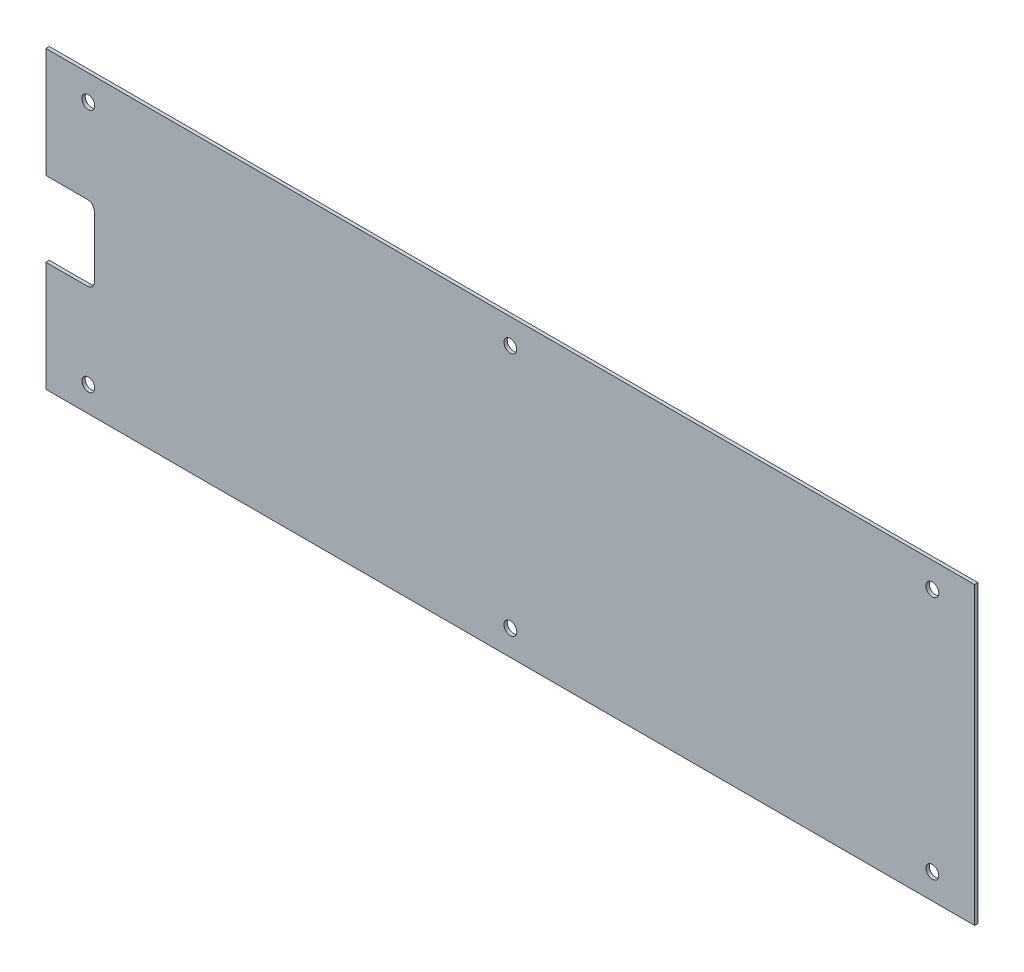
ISO-10303-21;
HEADER;
FILE_DESCRIPTION(('STEP AP214'),'2;1');
FILE_NAME('part.step','',(''),(''),'','','');
FILE_SCHEMA(('AUTOMOTIVE_DESIGN { 1 0 10303 214 1 1 1 1 }'));
ENDSEC;
DATA;
#1=APPLICATION_CONTEXT('core data for automotive mechanical design processes');
#2=APPLICATION_PROTOCOL_DEFINITION('international standard','automotive_design',2000,#1);
#3=PRODUCT_CONTEXT('',#1,'mechanical');
#4=PRODUCT('Part','Part','',(#3));
#5=PRODUCT_RELATED_PRODUCT_CATEGORY('part','',(#4));
#6=PRODUCT_DEFINITION_FORMATION('','',#4);
#7=PRODUCT_DEFINITION_CONTEXT('part definition',#1,'design');
#8=PRODUCT_DEFINITION('design','',#6,#7);
#9=PRODUCT_DEFINITION_SHAPE('','',#8);
#10=(LENGTH_UNIT() NAMED_UNIT(*) SI_UNIT(.MILLI.,.METRE.));
#11=(NAMED_UNIT(*) PLANE_ANGLE_UNIT() SI_UNIT($,.RADIAN.));
#12=(NAMED_UNIT(*) SI_UNIT($,.STERADIAN.) SOLID_ANGLE_UNIT());
#13=UNCERTAINTY_MEASURE_WITH_UNIT(LENGTH_MEASURE(1.E-05),#10,'distance_accuracy_value','');
#14=(GEOMETRIC_REPRESENTATION_CONTEXT(3) GLOBAL_UNCERTAINTY_ASSIGNED_CONTEXT((#13)) GLOBAL_UNIT_ASSIGNED_CONTEXT((#10,
#11,#12)) REPRESENTATION_CONTEXT('',''));
#15=CARTESIAN_POINT('',(0.,0.,0.));
#16=DIRECTION('',(0.,0.,1.));
#17=DIRECTION('',(1.,0.,0.));
#18=AXIS2_PLACEMENT_3D('',#15,#16,#17);
#19=CARTESIAN_POINT('',(0.,0.,0.79375));
#20=DIRECTION('',(1.,0.,0.));
#21=DIRECTION('',(0.,0.,-1.));
#22=AXIS2_PLACEMENT_3D('',#19,#20,#21);
#23=PLANE('',#22);
#24=DIRECTION('',(0.,-1.,0.));
#25=VECTOR('',#24,1.);
#26=CARTESIAN_POINT('',(0.,0.,0.));
#27=LINE('',#26,#25);
#28=CARTESIAN_POINT('',(0.,69.85,0.));
#29=VERTEX_POINT('',#28);
#30=CARTESIAN_POINT('',(0.,43.815,0.));
#31=VERTEX_POINT('',#30);
#32=EDGE_CURVE('E124',#29,#31,#27,.T.);
#33=ORIENTED_EDGE('',*,*,#32,.T.);
#34=DIRECTION('',(0.,0.,1.));
#35=VECTOR('',#34,1.);
#36=CARTESIAN_POINT('',(0.,43.815,-1.74625));
#37=LINE('',#36,#35);
#38=CARTESIAN_POINT('',(0.,43.815,0.79375));
#39=VERTEX_POINT('',#38);
#40=EDGE_CURVE('E110',#31,#39,#37,.T.);
#41=ORIENTED_EDGE('',*,*,#40,.T.);
#42=DIRECTION('',(0.,-1.,0.));
#43=VECTOR('',#42,1.);
#44=CARTESIAN_POINT('',(0.,0.,0.79375));
#45=LINE('',#44,#43);
#46=CARTESIAN_POINT('',(0.,69.85,0.79375));
#47=VERTEX_POINT('',#46);
#48=EDGE_CURVE('E122',#47,#39,#45,.T.);
#49=ORIENTED_EDGE('',*,*,#48,.F.);
#50=DIRECTION('',(0.,0.,-1.));
#51=VECTOR('',#50,1.);
#52=CARTESIAN_POINT('',(0.,69.85,0.79375));
#53=LINE('',#52,#51);
#54=EDGE_CURVE('E140',#47,#29,#53,.T.);
#55=ORIENTED_EDGE('',*,*,#54,.T.);
#56=EDGE_LOOP('',(#33,#41,#49,#55));
#57=FACE_BOUND('',#56,.T.);
#58=ADVANCED_FACE('F31',(#57),#23,.F.);
#59=CARTESIAN_POINT('',(0.,26.035,0.79375));
#60=VERTEX_POINT('',#59);
#61=CARTESIAN_POINT('',(0.,0.,0.79375));
#62=VERTEX_POINT('',#61);
#63=EDGE_CURVE('E130',#60,#62,#45,.T.);
#64=ORIENTED_EDGE('',*,*,#63,.F.);
#65=DIRECTION('',(0.,0.,1.));
#66=VECTOR('',#65,1.);
#67=CARTESIAN_POINT('',(0.,26.035,-1.74625));
#68=LINE('',#67,#66);
#69=CARTESIAN_POINT('',(0.,26.035,0.));
#70=VERTEX_POINT('',#69);
#71=EDGE_CURVE('E125',#70,#60,#68,.T.);
#72=ORIENTED_EDGE('',*,*,#71,.F.);
#73=CARTESIAN_POINT('',(0.,0.,0.));
#74=VERTEX_POINT('',#73);
#75=EDGE_CURVE('E222',#70,#74,#27,.T.);
#76=ORIENTED_EDGE('',*,*,#75,.T.);
#77=DIRECTION('',(0.,0.,-1.));
#78=VECTOR('',#77,1.);
#79=CARTESIAN_POINT('',(0.,0.,0.79375));
#80=LINE('',#79,#78);
#81=EDGE_CURVE('E148',#62,#74,#80,.T.);
#82=ORIENTED_EDGE('',*,*,#81,.F.);
#83=EDGE_LOOP('',(#64,#72,#76,#82));
#84=FACE_BOUND('',#83,.T.);
#85=ADVANCED_FACE('F33',(#84),#23,.F.);
#86=CARTESIAN_POINT('',(0.,0.,0.79375));
#87=DIRECTION('',(0.,1.,0.));
#88=DIRECTION('',(0.,0.,1.));
#89=AXIS2_PLACEMENT_3D('',#86,#87,#88);
#90=PLANE('',#89);
#91=DIRECTION('',(1.,0.,0.));
#92=VECTOR('',#91,1.);
#93=CARTESIAN_POINT('',(0.,0.,0.));
#94=LINE('',#93,#92);
#95=CARTESIAN_POINT('',(219.71,0.,0.));
#96=VERTEX_POINT('',#95);
#97=EDGE_CURVE('E224',#74,#96,#94,.T.);
#98=ORIENTED_EDGE('',*,*,#97,.T.);
#99=DIRECTION('',(0.,0.,-1.));
#100=VECTOR('',#99,1.);
#101=CARTESIAN_POINT('',(219.71,0.,0.79375));
#102=LINE('',#101,#100);
#103=CARTESIAN_POINT('',(219.71,0.,0.79375));
#104=VERTEX_POINT('',#103);
#105=EDGE_CURVE('E145',#104,#96,#102,.T.);
#106=ORIENTED_EDGE('',*,*,#105,.F.);
#107=DIRECTION('',(1.,0.,0.));
#108=VECTOR('',#107,1.);
#109=CARTESIAN_POINT('',(0.,0.,0.79375));
#110=LINE('',#109,#108);
#111=EDGE_CURVE('E129',#62,#104,#110,.T.);
#112=ORIENTED_EDGE('',*,*,#111,.F.);
#113=ORIENTED_EDGE('',*,*,#81,.T.);
#114=EDGE_LOOP('',(#98,#106,#112,#113));
#115=FACE_BOUND('',#114,.T.);
#116=ADVANCED_FACE('F237',(#115),#90,.F.);
#117=CARTESIAN_POINT('',(219.71,0.,0.79375));
#118=DIRECTION('',(-1.,0.,0.));
#119=DIRECTION('',(0.,0.,1.));
#120=AXIS2_PLACEMENT_3D('',#117,#118,#119);
#121=PLANE('',#120);
#122=DIRECTION('',(0.,1.,0.));
#123=VECTOR('',#122,1.);
#124=CARTESIAN_POINT('',(219.71,0.,0.));
#125=LINE('',#124,#123);
#126=CARTESIAN_POINT('',(219.71,69.85,0.));
#127=VERTEX_POINT('',#126);
#128=EDGE_CURVE('E225',#96,#127,#125,.T.);
#129=ORIENTED_EDGE('',*,*,#128,.T.);
#130=DIRECTION('',(0.,0.,-1.));
#131=VECTOR('',#130,1.);
#132=CARTESIAN_POINT('',(219.71,69.85,0.79375));
#133=LINE('',#132,#131);
#134=CARTESIAN_POINT('',(219.71,69.85,0.79375));
#135=VERTEX_POINT('',#134);
#136=EDGE_CURVE('E142',#135,#127,#133,.T.);
#137=ORIENTED_EDGE('',*,*,#136,.F.);
#138=DIRECTION('',(0.,1.,0.));
#139=VECTOR('',#138,1.);
#140=CARTESIAN_POINT('',(219.71,0.,0.79375));
#141=LINE('',#140,#139);
#142=EDGE_CURVE('E132',#104,#135,#141,.T.);
#143=ORIENTED_EDGE('',*,*,#142,.F.);
#144=ORIENTED_EDGE('',*,*,#105,.T.);
#145=EDGE_LOOP('',(#129,#137,#143,#144));
#146=FACE_BOUND('',#145,.T.);
#147=ADVANCED_FACE('F248',(#146),#121,.F.);
#148=CARTESIAN_POINT('',(0.,69.85,0.79375));
#149=DIRECTION('',(0.,-1.,0.));
#150=DIRECTION('',(0.,0.,-1.));
#151=AXIS2_PLACEMENT_3D('',#148,#149,#150);
#152=PLANE('',#151);
#153=DIRECTION('',(-1.,0.,0.));
#154=VECTOR('',#153,1.);
#155=CARTESIAN_POINT('',(0.,69.85,0.));
#156=LINE('',#155,#154);
#157=EDGE_CURVE('E134',#127,#29,#156,.T.);
#158=ORIENTED_EDGE('',*,*,#157,.T.);
#159=ORIENTED_EDGE('',*,*,#54,.F.);
#160=DIRECTION('',(-1.,0.,0.));
#161=VECTOR('',#160,1.);
#162=CARTESIAN_POINT('',(0.,69.85,0.79375));
#163=LINE('',#162,#161);
#164=EDGE_CURVE('E54',#135,#47,#163,.T.);
#165=ORIENTED_EDGE('',*,*,#164,.F.);
#166=ORIENTED_EDGE('',*,*,#136,.T.);
#167=EDGE_LOOP('',(#158,#159,#165,#166));
#168=FACE_BOUND('',#167,.T.);
#169=ADVANCED_FACE('F231',(#168),#152,.F.);
#170=CARTESIAN_POINT('',(0.,69.85,0.79375));
#171=DIRECTION('',(0.,0.,-1.));
#172=DIRECTION('',(-1.,0.,0.));
#173=AXIS2_PLACEMENT_3D('',#170,#171,#172);
#174=PLANE('',#173);
#175=CARTESIAN_POINT('',(10.0076,63.8556,0.79375));
#176=DIRECTION('',(0.,0.,1.));
#177=DIRECTION('',(-1.,0.,0.));
#178=AXIS2_PLACEMENT_3D('',#175,#176,#177);
#179=CIRCLE('',#178,1.524);
#180=CARTESIAN_POINT('',(8.4836,63.8556,0.79375));
#181=VERTEX_POINT('',#180);
#182=EDGE_CURVE('E186',#181,#181,#179,.T.);
#183=ORIENTED_EDGE('',*,*,#182,.F.);
#184=EDGE_LOOP('',(#183));
#185=FACE_BOUND('',#184,.T.);
#186=CARTESIAN_POINT('',(10.0076,5.99440000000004,0.79375));
#187=DIRECTION('',(0.,0.,1.));
#188=DIRECTION('',(1.,0.,0.));
#189=AXIS2_PLACEMENT_3D('',#186,#187,#188);
#190=CIRCLE('',#189,1.524);
#191=CARTESIAN_POINT('',(11.5316,5.99440000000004,0.79375));
#192=VERTEX_POINT('',#191);
#193=EDGE_CURVE('E192',#192,#192,#190,.T.);
#194=ORIENTED_EDGE('',*,*,#193,.F.);
#195=EDGE_LOOP('',(#194));
#196=FACE_BOUND('',#195,.T.);
#197=CARTESIAN_POINT('',(209.7024,5.99440000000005,0.79375));
#198=DIRECTION('',(0.,0.,1.));
#199=DIRECTION('',(-1.,0.,0.));
#200=AXIS2_PLACEMENT_3D('',#197,#198,#199);
#201=CIRCLE('',#200,1.52400000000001);
#202=CARTESIAN_POINT('',(208.1784,5.99440000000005,0.79375));
#203=VERTEX_POINT('',#202);
#204=EDGE_CURVE('E198',#203,#203,#201,.T.);
#205=ORIENTED_EDGE('',*,*,#204,.F.);
#206=EDGE_LOOP('',(#205));
#207=FACE_BOUND('',#206,.T.);
#208=CARTESIAN_POINT('',(109.855,5.99440000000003,0.79375));
#209=DIRECTION('',(0.,0.,1.));
#210=DIRECTION('',(-1.,0.,0.));
#211=AXIS2_PLACEMENT_3D('',#208,#209,#210);
#212=CIRCLE('',#211,1.52399999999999);
#213=CARTESIAN_POINT('',(108.331,5.99440000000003,0.79375));
#214=VERTEX_POINT('',#213);
#215=EDGE_CURVE('E204',#214,#214,#212,.T.);
#216=ORIENTED_EDGE('',*,*,#215,.F.);
#217=EDGE_LOOP('',(#216));
#218=FACE_BOUND('',#217,.T.);
#219=CARTESIAN_POINT('',(109.855,63.8556,0.79375));
#220=DIRECTION('',(0.,0.,1.));
#221=DIRECTION('',(1.,0.,0.));
#222=AXIS2_PLACEMENT_3D('',#219,#220,#221);
#223=CIRCLE('',#222,1.52399999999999);
#224=CARTESIAN_POINT('',(111.379,63.8556,0.79375));
#225=VERTEX_POINT('',#224);
#226=EDGE_CURVE('E210',#225,#225,#223,.T.);
#227=ORIENTED_EDGE('',*,*,#226,.F.);
#228=EDGE_LOOP('',(#227));
#229=FACE_BOUND('',#228,.T.);
#230=CARTESIAN_POINT('',(209.7024,63.8556,0.79375));
#231=DIRECTION('',(0.,0.,1.));
#232=DIRECTION('',(1.,0.,0.));
#233=AXIS2_PLACEMENT_3D('',#230,#231,#232);
#234=CIRCLE('',#233,1.52400000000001);
#235=CARTESIAN_POINT('',(211.2264,63.8556,0.79375));
#236=VERTEX_POINT('',#235);
#237=EDGE_CURVE('E216',#236,#236,#234,.T.);
#238=ORIENTED_EDGE('',*,*,#237,.F.);
#239=EDGE_LOOP('',(#238));
#240=FACE_BOUND('',#239,.T.);
#241=ORIENTED_EDGE('',*,*,#48,.T.);
#242=DIRECTION('',(-1.,0.,0.));
#243=VECTOR('',#242,1.);
#244=CARTESIAN_POINT('',(0.,43.815,0.79375));
#245=LINE('',#244,#243);
#246=CARTESIAN_POINT('',(9.8425,43.815,0.79375));
#247=VERTEX_POINT('',#246);
#248=EDGE_CURVE('E107',#247,#39,#245,.T.);
#249=ORIENTED_EDGE('',*,*,#248,.F.);
#250=CARTESIAN_POINT('',(9.8425,42.2275,0.79375));
#251=DIRECTION('',(0.,0.,1.));
#252=DIRECTION('',(-1.,0.,0.));
#253=AXIS2_PLACEMENT_3D('',#250,#251,#252);
#254=CIRCLE('',#253,1.5875);
#255=CARTESIAN_POINT('',(11.43,42.2275,0.79375));
#256=VERTEX_POINT('',#255);
#257=EDGE_CURVE('E126',#256,#247,#254,.T.);
#258=ORIENTED_EDGE('',*,*,#257,.F.);
#259=DIRECTION('',(0.,1.,0.));
#260=VECTOR('',#259,1.);
#261=CARTESIAN_POINT('',(11.43,42.2275,0.79375));
#262=LINE('',#261,#260);
#263=CARTESIAN_POINT('',(11.43,27.6225,0.79375));
#264=VERTEX_POINT('',#263);
#265=EDGE_CURVE('E168',#264,#256,#262,.T.);
#266=ORIENTED_EDGE('',*,*,#265,.F.);
#267=CARTESIAN_POINT('',(9.8425,27.6225,0.79375));
#268=DIRECTION('',(0.,0.,1.));
#269=DIRECTION('',(1.,0.,0.));
#270=AXIS2_PLACEMENT_3D('',#267,#268,#269);
#271=CIRCLE('',#270,1.5875);
#272=CARTESIAN_POINT('',(9.8425,26.035,0.79375));
#273=VERTEX_POINT('',#272);
#274=EDGE_CURVE('E180',#273,#264,#271,.T.);
#275=ORIENTED_EDGE('',*,*,#274,.F.);
#276=DIRECTION('',(1.,0.,0.));
#277=VECTOR('',#276,1.);
#278=CARTESIAN_POINT('',(0.,26.035,0.79375));
#279=LINE('',#278,#277);
#280=EDGE_CURVE('E116',#60,#273,#279,.T.);
#281=ORIENTED_EDGE('',*,*,#280,.F.);
#282=ORIENTED_EDGE('',*,*,#63,.T.);
#283=ORIENTED_EDGE('',*,*,#111,.T.);
#284=ORIENTED_EDGE('',*,*,#142,.T.);
#285=ORIENTED_EDGE('',*,*,#164,.T.);
#286=EDGE_LOOP('',(#241,#249,#258,#266,#275,#281,#282,#283,#284,#285));
#287=FACE_BOUND('',#286,.T.);
#288=ADVANCED_FACE('F128',(#185,#196,#207,#218,#229,#240,#287),#174,.F.);
#289=CARTESIAN_POINT('',(0.,69.85,0.));
#290=DIRECTION('',(0.,0.,-1.));
#291=DIRECTION('',(-1.,0.,0.));
#292=AXIS2_PLACEMENT_3D('',#289,#290,#291);
#293=PLANE('',#292);
#294=DIRECTION('',(1.,0.,0.));
#295=VECTOR('',#294,1.);
#296=CARTESIAN_POINT('',(0.,43.815,0.));
#297=LINE('',#296,#295);
#298=CARTESIAN_POINT('',(9.8425,43.815,0.));
#299=VERTEX_POINT('',#298);
#300=EDGE_CURVE('E11',#31,#299,#297,.T.);
#301=ORIENTED_EDGE('',*,*,#300,.F.);
#302=ORIENTED_EDGE('',*,*,#32,.F.);
#303=ORIENTED_EDGE('',*,*,#157,.F.);
#304=ORIENTED_EDGE('',*,*,#128,.F.);
#305=ORIENTED_EDGE('',*,*,#97,.F.);
#306=ORIENTED_EDGE('',*,*,#75,.F.);
#307=DIRECTION('',(-1.,0.,0.));
#308=VECTOR('',#307,1.);
#309=CARTESIAN_POINT('',(0.,26.035,0.));
#310=LINE('',#309,#308);
#311=CARTESIAN_POINT('',(9.8425,26.035,0.));
#312=VERTEX_POINT('',#311);
#313=EDGE_CURVE('E151',#312,#70,#310,.T.);
#314=ORIENTED_EDGE('',*,*,#313,.F.);
#315=CARTESIAN_POINT('',(9.8425,27.6225,0.));
#316=DIRECTION('',(0.,0.,-1.));
#317=DIRECTION('',(-1.,0.,0.));
#318=AXIS2_PLACEMENT_3D('',#315,#316,#317);
#319=CIRCLE('',#318,1.5875);
#320=CARTESIAN_POINT('',(11.43,27.6225,0.));
#321=VERTEX_POINT('',#320);
#322=EDGE_CURVE('E153',#321,#312,#319,.T.);
#323=ORIENTED_EDGE('',*,*,#322,.F.);
#324=DIRECTION('',(0.,-1.,0.));
#325=VECTOR('',#324,1.);
#326=CARTESIAN_POINT('',(11.43,69.85,0.));
#327=LINE('',#326,#325);
#328=CARTESIAN_POINT('',(11.43,42.2275,0.));
#329=VERTEX_POINT('',#328);
#330=EDGE_CURVE('E155',#329,#321,#327,.T.);
#331=ORIENTED_EDGE('',*,*,#330,.F.);
#332=CARTESIAN_POINT('',(9.8425,42.2275,0.));
#333=DIRECTION('',(0.,0.,-1.));
#334=DIRECTION('',(-1.,0.,0.));
#335=AXIS2_PLACEMENT_3D('',#332,#333,#334);
#336=CIRCLE('',#335,1.5875);
#337=EDGE_CURVE('E39',#299,#329,#336,.T.);
#338=ORIENTED_EDGE('',*,*,#337,.F.);
#339=EDGE_LOOP('',(#301,#302,#303,#304,#305,#306,#314,#323,#331,#338));
#340=FACE_BOUND('',#339,.T.);
#341=CARTESIAN_POINT('',(10.0076,63.8556,0.));
#342=DIRECTION('',(0.,0.,1.));
#343=DIRECTION('',(-1.,0.,0.));
#344=AXIS2_PLACEMENT_3D('',#341,#342,#343);
#345=CIRCLE('',#344,1.524);
#346=CARTESIAN_POINT('',(8.4836,63.8556,0.));
#347=VERTEX_POINT('',#346);
#348=EDGE_CURVE('E189',#347,#347,#345,.T.);
#349=ORIENTED_EDGE('',*,*,#348,.T.);
#350=EDGE_LOOP('',(#349));
#351=FACE_BOUND('',#350,.T.);
#352=CARTESIAN_POINT('',(10.0076,5.99440000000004,0.));
#353=DIRECTION('',(0.,0.,1.));
#354=DIRECTION('',(1.,0.,0.));
#355=AXIS2_PLACEMENT_3D('',#352,#353,#354);
#356=CIRCLE('',#355,1.524);
#357=CARTESIAN_POINT('',(11.5316,5.99440000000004,0.));
#358=VERTEX_POINT('',#357);
#359=EDGE_CURVE('E195',#358,#358,#356,.T.);
#360=ORIENTED_EDGE('',*,*,#359,.T.);
#361=EDGE_LOOP('',(#360));
#362=FACE_BOUND('',#361,.T.);
#363=CARTESIAN_POINT('',(209.7024,5.99440000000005,0.));
#364=DIRECTION('',(0.,0.,1.));
#365=DIRECTION('',(-1.,0.,0.));
#366=AXIS2_PLACEMENT_3D('',#363,#364,#365);
#367=CIRCLE('',#366,1.52400000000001);
#368=CARTESIAN_POINT('',(208.1784,5.99440000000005,0.));
#369=VERTEX_POINT('',#368);
#370=EDGE_CURVE('E201',#369,#369,#367,.T.);
#371=ORIENTED_EDGE('',*,*,#370,.T.);
#372=EDGE_LOOP('',(#371));
#373=FACE_BOUND('',#372,.T.);
#374=CARTESIAN_POINT('',(109.855,5.99440000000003,0.));
#375=DIRECTION('',(0.,0.,1.));
#376=DIRECTION('',(-1.,0.,0.));
#377=AXIS2_PLACEMENT_3D('',#374,#375,#376);
#378=CIRCLE('',#377,1.52399999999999);
#379=CARTESIAN_POINT('',(108.331,5.99440000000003,0.));
#380=VERTEX_POINT('',#379);
#381=EDGE_CURVE('E207',#380,#380,#378,.T.);
#382=ORIENTED_EDGE('',*,*,#381,.T.);
#383=EDGE_LOOP('',(#382));
#384=FACE_BOUND('',#383,.T.);
#385=CARTESIAN_POINT('',(109.855,63.8556,0.));
#386=DIRECTION('',(0.,0.,1.));
#387=DIRECTION('',(1.,0.,0.));
#388=AXIS2_PLACEMENT_3D('',#385,#386,#387);
#389=CIRCLE('',#388,1.52399999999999);
#390=CARTESIAN_POINT('',(111.379,63.8556,0.));
#391=VERTEX_POINT('',#390);
#392=EDGE_CURVE('E213',#391,#391,#389,.T.);
#393=ORIENTED_EDGE('',*,*,#392,.T.);
#394=EDGE_LOOP('',(#393));
#395=FACE_BOUND('',#394,.T.);
#396=CARTESIAN_POINT('',(209.7024,63.8556,0.));
#397=DIRECTION('',(0.,0.,1.));
#398=DIRECTION('',(1.,0.,0.));
#399=AXIS2_PLACEMENT_3D('',#396,#397,#398);
#400=CIRCLE('',#399,1.52400000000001);
#401=CARTESIAN_POINT('',(211.2264,63.8556,0.));
#402=VERTEX_POINT('',#401);
#403=EDGE_CURVE('E219',#402,#402,#400,.T.);
#404=ORIENTED_EDGE('',*,*,#403,.T.);
#405=EDGE_LOOP('',(#404));
#406=FACE_BOUND('',#405,.T.);
#407=ADVANCED_FACE('F172',(#340,#351,#362,#373,#384,#395,#406),#293,.T.);
#408=CARTESIAN_POINT('',(209.7024,63.8556,0.));
#409=DIRECTION('',(0.,0.,1.));
#410=DIRECTION('',(1.,0.,0.));
#411=AXIS2_PLACEMENT_3D('',#408,#409,#410);
#412=CYLINDRICAL_SURFACE('',#411,1.52400000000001);
#413=ORIENTED_EDGE('',*,*,#403,.F.);
#414=EDGE_LOOP('',(#413));
#415=FACE_BOUND('',#414,.T.);
#416=ORIENTED_EDGE('',*,*,#237,.T.);
#417=EDGE_LOOP('',(#416));
#418=FACE_BOUND('',#417,.T.);
#419=ADVANCED_FACE('F284',(#415,#418),#412,.F.);
#420=CARTESIAN_POINT('',(109.855,63.8556,0.));
#421=DIRECTION('',(0.,0.,1.));
#422=DIRECTION('',(1.,0.,0.));
#423=AXIS2_PLACEMENT_3D('',#420,#421,#422);
#424=CYLINDRICAL_SURFACE('',#423,1.52399999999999);
#425=ORIENTED_EDGE('',*,*,#392,.F.);
#426=EDGE_LOOP('',(#425));
#427=FACE_BOUND('',#426,.T.);
#428=ORIENTED_EDGE('',*,*,#226,.T.);
#429=EDGE_LOOP('',(#428));
#430=FACE_BOUND('',#429,.T.);
#431=ADVANCED_FACE('F289',(#427,#430),#424,.F.);
#432=CARTESIAN_POINT('',(109.855,5.99440000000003,0.));
#433=DIRECTION('',(0.,0.,1.));
#434=DIRECTION('',(1.,0.,0.));
#435=AXIS2_PLACEMENT_3D('',#432,#433,#434);
#436=CYLINDRICAL_SURFACE('',#435,1.52399999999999);
#437=ORIENTED_EDGE('',*,*,#381,.F.);
#438=EDGE_LOOP('',(#437));
#439=FACE_BOUND('',#438,.T.);
#440=ORIENTED_EDGE('',*,*,#215,.T.);
#441=EDGE_LOOP('',(#440));
#442=FACE_BOUND('',#441,.T.);
#443=ADVANCED_FACE('F301',(#439,#442),#436,.F.);
#444=CARTESIAN_POINT('',(209.7024,5.99440000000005,0.));
#445=DIRECTION('',(0.,0.,1.));
#446=DIRECTION('',(1.,0.,0.));
#447=AXIS2_PLACEMENT_3D('',#444,#445,#446);
#448=CYLINDRICAL_SURFACE('',#447,1.52400000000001);
#449=ORIENTED_EDGE('',*,*,#370,.F.);
#450=EDGE_LOOP('',(#449));
#451=FACE_BOUND('',#450,.T.);
#452=ORIENTED_EDGE('',*,*,#204,.T.);
#453=EDGE_LOOP('',(#452));
#454=FACE_BOUND('',#453,.T.);
#455=ADVANCED_FACE('F311',(#451,#454),#448,.F.);
#456=CARTESIAN_POINT('',(10.0076,5.99440000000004,0.));
#457=DIRECTION('',(0.,0.,1.));
#458=DIRECTION('',(1.,0.,0.));
#459=AXIS2_PLACEMENT_3D('',#456,#457,#458);
#460=CYLINDRICAL_SURFACE('',#459,1.524);
#461=ORIENTED_EDGE('',*,*,#359,.F.);
#462=EDGE_LOOP('',(#461));
#463=FACE_BOUND('',#462,.T.);
#464=ORIENTED_EDGE('',*,*,#193,.T.);
#465=EDGE_LOOP('',(#464));
#466=FACE_BOUND('',#465,.T.);
#467=ADVANCED_FACE('F321',(#463,#466),#460,.F.);
#468=CARTESIAN_POINT('',(10.0076,63.8556,0.));
#469=DIRECTION('',(0.,0.,1.));
#470=DIRECTION('',(1.,0.,0.));
#471=AXIS2_PLACEMENT_3D('',#468,#469,#470);
#472=CYLINDRICAL_SURFACE('',#471,1.524);
#473=ORIENTED_EDGE('',*,*,#348,.F.);
#474=EDGE_LOOP('',(#473));
#475=FACE_BOUND('',#474,.T.);
#476=ORIENTED_EDGE('',*,*,#182,.T.);
#477=EDGE_LOOP('',(#476));
#478=FACE_BOUND('',#477,.T.);
#479=ADVANCED_FACE('F331',(#475,#478),#472,.F.);
#480=CARTESIAN_POINT('',(0.,43.815,-1.74625));
#481=DIRECTION('',(0.,1.,0.));
#482=DIRECTION('',(0.,0.,1.));
#483=AXIS2_PLACEMENT_3D('',#480,#481,#482);
#484=PLANE('',#483);
#485=ORIENTED_EDGE('',*,*,#300,.T.);
#486=DIRECTION('',(0.,0.,1.));
#487=VECTOR('',#486,1.);
#488=CARTESIAN_POINT('',(9.8425,43.815,-1.74625));
#489=LINE('',#488,#487);
#490=EDGE_CURVE('E113',#299,#247,#489,.T.);
#491=ORIENTED_EDGE('',*,*,#490,.T.);
#492=ORIENTED_EDGE('',*,*,#248,.T.);
#493=ORIENTED_EDGE('',*,*,#40,.F.);
#494=EDGE_LOOP('',(#485,#491,#492,#493));
#495=FACE_BOUND('',#494,.T.);
#496=ADVANCED_FACE('F109',(#495),#484,.F.);
#497=CARTESIAN_POINT('',(9.8425,42.2275,-1.74625));
#498=DIRECTION('',(0.,0.,1.));
#499=DIRECTION('',(1.,0.,0.));
#500=AXIS2_PLACEMENT_3D('',#497,#498,#499);
#501=CYLINDRICAL_SURFACE('',#500,1.5875);
#502=ORIENTED_EDGE('',*,*,#337,.T.);
#503=DIRECTION('',(0.,0.,1.));
#504=VECTOR('',#503,1.);
#505=CARTESIAN_POINT('',(11.43,42.2275,-1.74625));
#506=LINE('',#505,#504);
#507=EDGE_CURVE('E160',#329,#256,#506,.T.);
#508=ORIENTED_EDGE('',*,*,#507,.T.);
#509=ORIENTED_EDGE('',*,*,#257,.T.);
#510=ORIENTED_EDGE('',*,*,#490,.F.);
#511=EDGE_LOOP('',(#502,#508,#509,#510));
#512=FACE_BOUND('',#511,.T.);
#513=ADVANCED_FACE('F159',(#512),#501,.F.);
#514=CARTESIAN_POINT('',(11.43,42.2275,-1.74625));
#515=DIRECTION('',(1.,0.,0.));
#516=DIRECTION('',(0.,0.,-1.));
#517=AXIS2_PLACEMENT_3D('',#514,#515,#516);
#518=PLANE('',#517);
#519=ORIENTED_EDGE('',*,*,#330,.T.);
#520=DIRECTION('',(0.,0.,1.));
#521=VECTOR('',#520,1.);
#522=CARTESIAN_POINT('',(11.43,27.6225,-1.74625));
#523=LINE('',#522,#521);
#524=EDGE_CURVE('E169',#321,#264,#523,.T.);
#525=ORIENTED_EDGE('',*,*,#524,.T.);
#526=ORIENTED_EDGE('',*,*,#265,.T.);
#527=ORIENTED_EDGE('',*,*,#507,.F.);
#528=EDGE_LOOP('',(#519,#525,#526,#527));
#529=FACE_BOUND('',#528,.T.);
#530=ADVANCED_FACE('F165',(#529),#518,.F.);
#531=CARTESIAN_POINT('',(9.8425,27.6225,-1.74625));
#532=DIRECTION('',(0.,0.,1.));
#533=DIRECTION('',(1.,0.,0.));
#534=AXIS2_PLACEMENT_3D('',#531,#532,#533);
#535=CYLINDRICAL_SURFACE('',#534,1.5875);
#536=ORIENTED_EDGE('',*,*,#322,.T.);
#537=DIRECTION('',(0.,0.,1.));
#538=VECTOR('',#537,1.);
#539=CARTESIAN_POINT('',(9.8425,26.035,-1.74625));
#540=LINE('',#539,#538);
#541=EDGE_CURVE('E46',#312,#273,#540,.T.);
#542=ORIENTED_EDGE('',*,*,#541,.T.);
#543=ORIENTED_EDGE('',*,*,#274,.T.);
#544=ORIENTED_EDGE('',*,*,#524,.F.);
#545=EDGE_LOOP('',(#536,#542,#543,#544));
#546=FACE_BOUND('',#545,.T.);
#547=ADVANCED_FACE('F177',(#546),#535,.F.);
#548=CARTESIAN_POINT('',(0.,26.035,-1.74625));
#549=DIRECTION('',(0.,-1.,0.));
#550=DIRECTION('',(0.,0.,-1.));
#551=AXIS2_PLACEMENT_3D('',#548,#549,#550);
#552=PLANE('',#551);
#553=ORIENTED_EDGE('',*,*,#313,.T.);
#554=ORIENTED_EDGE('',*,*,#71,.T.);
#555=ORIENTED_EDGE('',*,*,#280,.T.);
#556=ORIENTED_EDGE('',*,*,#541,.F.);
#557=EDGE_LOOP('',(#553,#554,#555,#556));
#558=FACE_BOUND('',#557,.T.);
#559=ADVANCED_FACE('F242',(#558),#552,.F.);
#560=CLOSED_SHELL('',(#58,#85,#116,#147,#169,#288,#407,#419,#431,#443,#455,#467,#479,#496,#513,
#530,#547,#559));
#561=MANIFOLD_SOLID_BREP('B2',#560);
#562=ADVANCED_BREP_SHAPE_REPRESENTATION('',(#18,#561),#14);
#563=SHAPE_DEFINITION_REPRESENTATION(#9,#562);
ENDSEC;
END-ISO-10303-21;
